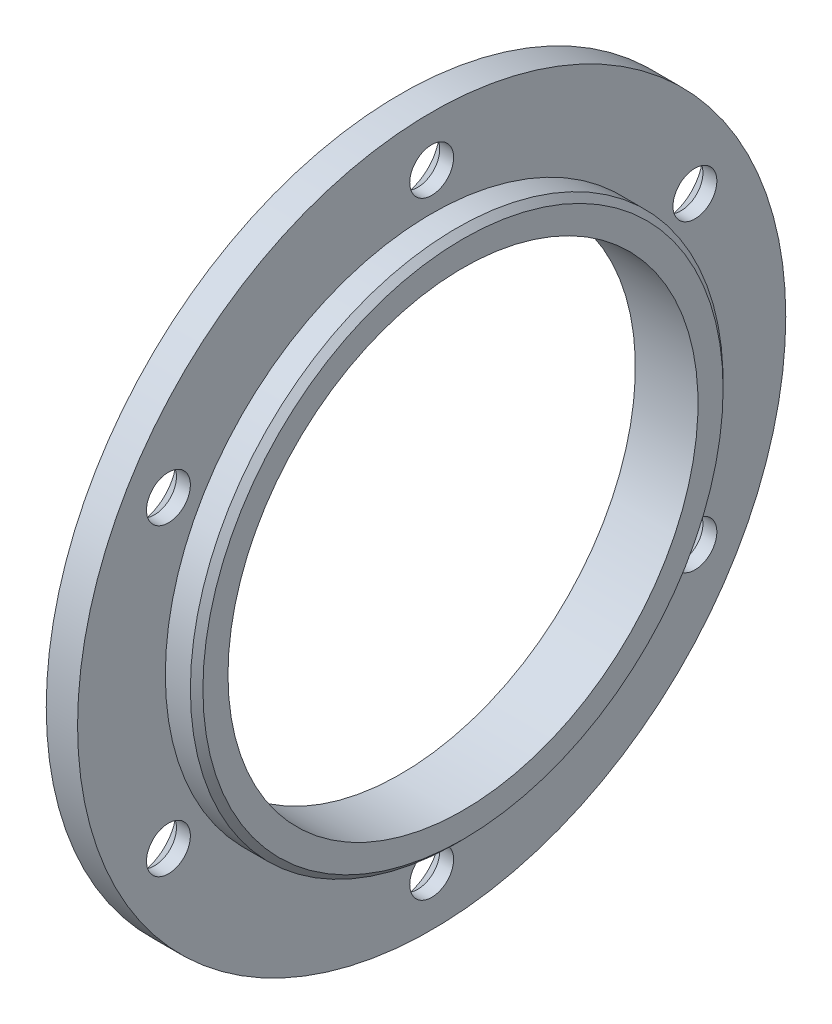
from build123d import *

# Parameters (mm, degrees)
ESQUISSE3_R      = 3.5
EXTRUSION2_DEPTH = 9
CHANFREIN1_SIZE  = 2.78


with BuildPart() as part:
    # Esquisse1 → R_volution1 (revolve)
    with BuildSketch(Plane.XY, mode=Mode.PRIVATE) as r_volution1_sk:
        Polygon((5, 42.5), (5, 56.5), (0, 56.5), (0, 37.5), (10, 37.5), (10, 41.5), (9, 42.5), align=None)
    revolve(r_volution1_sk.sketch.rotate(Axis((-20.424351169, 0, 0), (1, 0, 0)), 90), axis=Axis((-20.424351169, 0, 0), (1, 0, 0)))

    # Esquisse3 → Extrusion2 (cut)
    with BuildSketch(Plane.ZY):
        with Locations((0, 48.5)):
            Circle(ESQUISSE3_R)
        with Locations((42.002232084, 24.25)):
            Circle(ESQUISSE3_R)
        with Locations((42.002232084, -24.25)):
            Circle(ESQUISSE3_R)
        with Locations((0, -48.5)):
            Circle(ESQUISSE3_R)
        with Locations((-42.002232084, -24.25)):
            Circle(ESQUISSE3_R)
        with Locations((-42.002232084, 24.25)):
            Circle(ESQUISSE3_R)
    extrude(amount=-EXTRUSION2_DEPTH, mode=Mode.SUBTRACT)

    # Chanfrein1
    chanfrein1_edges = [part.edges().sort_by_distance(p)[0] for p in [
        (0, 48.5, -3.5),
        (0, 24.25, 38.502232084),
        (0, -24.25, 38.502232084),
        (0, -48.5, -3.5),
        (0, -24.25, -45.502232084),
        (0, 24.25, -45.502232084),
    ]]
    chamfer(chanfrein1_edges, length=CHANFREIN1_SIZE)


solid = part.part
